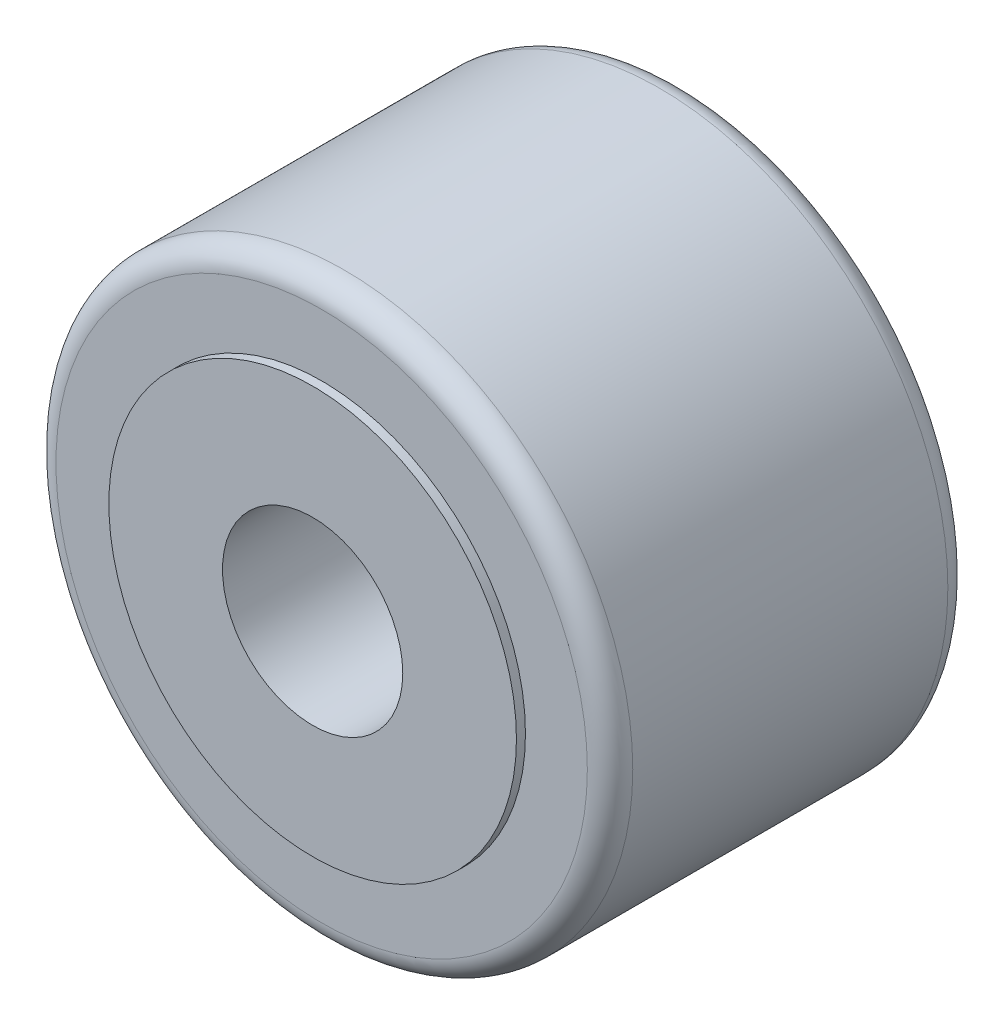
ISO-10303-21;
HEADER;
FILE_DESCRIPTION(('STEP AP214'),'2;1');
FILE_NAME('part.step','',(''),(''),'','','');
FILE_SCHEMA(('AUTOMOTIVE_DESIGN { 1 0 10303 214 1 1 1 1 }'));
ENDSEC;
DATA;
#1=APPLICATION_CONTEXT('core data for automotive mechanical design processes');
#2=APPLICATION_PROTOCOL_DEFINITION('international standard','automotive_design',2000,#1);
#3=PRODUCT_CONTEXT('',#1,'mechanical');
#4=PRODUCT('Part','Part','',(#3));
#5=PRODUCT_RELATED_PRODUCT_CATEGORY('part','',(#4));
#6=PRODUCT_DEFINITION_FORMATION('','',#4);
#7=PRODUCT_DEFINITION_CONTEXT('part definition',#1,'design');
#8=PRODUCT_DEFINITION('design','',#6,#7);
#9=PRODUCT_DEFINITION_SHAPE('','',#8);
#10=(LENGTH_UNIT() NAMED_UNIT(*) SI_UNIT(.MILLI.,.METRE.));
#11=(NAMED_UNIT(*) PLANE_ANGLE_UNIT() SI_UNIT($,.RADIAN.));
#12=(NAMED_UNIT(*) SI_UNIT($,.STERADIAN.) SOLID_ANGLE_UNIT());
#13=UNCERTAINTY_MEASURE_WITH_UNIT(LENGTH_MEASURE(1.E-05),#10,'distance_accuracy_value','');
#14=(GEOMETRIC_REPRESENTATION_CONTEXT(3) GLOBAL_UNCERTAINTY_ASSIGNED_CONTEXT((#13)) GLOBAL_UNIT_ASSIGNED_CONTEXT((#10,
#11,#12)) REPRESENTATION_CONTEXT('',''));
#15=CARTESIAN_POINT('',(0.,0.,0.));
#16=DIRECTION('',(0.,0.,1.));
#17=DIRECTION('',(1.,0.,0.));
#18=AXIS2_PLACEMENT_3D('',#15,#16,#17);
#19=CARTESIAN_POINT('',(0.,0.,-15.875));
#20=DIRECTION('',(0.,0.,1.));
#21=DIRECTION('',(1.,0.,0.));
#22=AXIS2_PLACEMENT_3D('',#19,#20,#21);
#23=CYLINDRICAL_SURFACE('',#22,25.4);
#24=CARTESIAN_POINT('',(0.,0.,-13.875));
#25=DIRECTION('',(0.,0.,1.));
#26=DIRECTION('',(1.,0.,0.));
#27=AXIS2_PLACEMENT_3D('',#24,#25,#26);
#28=CIRCLE('',#27,25.4);
#29=CARTESIAN_POINT('',(25.4,0.,-13.875));
#30=VERTEX_POINT('',#29);
#31=EDGE_CURVE('E41',#30,#30,#28,.T.);
#32=ORIENTED_EDGE('',*,*,#31,.T.);
#33=EDGE_LOOP('',(#32));
#34=FACE_BOUND('',#33,.T.);
#35=CARTESIAN_POINT('',(0.,0.,13.875));
#36=DIRECTION('',(0.,0.,1.));
#37=DIRECTION('',(1.,0.,0.));
#38=AXIS2_PLACEMENT_3D('',#35,#36,#37);
#39=CIRCLE('',#38,25.4);
#40=CARTESIAN_POINT('',(25.4,0.,13.875));
#41=VERTEX_POINT('',#40);
#42=EDGE_CURVE('E45',#41,#41,#39,.F.);
#43=ORIENTED_EDGE('',*,*,#42,.T.);
#44=EDGE_LOOP('',(#43));
#45=FACE_BOUND('',#44,.T.);
#46=ADVANCED_FACE('F30',(#34,#45),#23,.T.);
#47=CARTESIAN_POINT('',(0.,0.,-15.875));
#48=DIRECTION('',(0.,0.,1.));
#49=DIRECTION('',(1.,0.,0.));
#50=AXIS2_PLACEMENT_3D('',#47,#48,#49);
#51=PLANE('',#50);
#52=CARTESIAN_POINT('',(0.,0.,-15.875));
#53=DIRECTION('',(0.,0.,1.));
#54=DIRECTION('',(1.,0.,0.));
#55=AXIS2_PLACEMENT_3D('',#52,#53,#54);
#56=CIRCLE('',#55,23.4);
#57=CARTESIAN_POINT('',(23.4,0.,-15.875));
#58=VERTEX_POINT('',#57);
#59=EDGE_CURVE('E37',#58,#58,#56,.F.);
#60=ORIENTED_EDGE('',*,*,#59,.T.);
#61=EDGE_LOOP('',(#60));
#62=FACE_BOUND('',#61,.T.);
#63=CARTESIAN_POINT('',(0.,0.,-15.875));
#64=DIRECTION('',(0.,0.,1.));
#65=DIRECTION('',(1.,0.,0.));
#66=AXIS2_PLACEMENT_3D('',#63,#64,#65);
#67=CIRCLE('',#66,17.95);
#68=CARTESIAN_POINT('',(17.95,0.,-15.875));
#69=VERTEX_POINT('',#68);
#70=EDGE_CURVE('E53',#69,#69,#67,.T.);
#71=ORIENTED_EDGE('',*,*,#70,.T.);
#72=EDGE_LOOP('',(#71));
#73=FACE_BOUND('',#72,.T.);
#74=ADVANCED_FACE('F91',(#62,#73),#51,.F.);
#75=CARTESIAN_POINT('',(0.,0.,15.875));
#76=DIRECTION('',(0.,0.,1.));
#77=DIRECTION('',(1.,0.,0.));
#78=AXIS2_PLACEMENT_3D('',#75,#76,#77);
#79=PLANE('',#78);
#80=CARTESIAN_POINT('',(0.,0.,15.875));
#81=DIRECTION('',(0.,0.,1.));
#82=DIRECTION('',(1.,0.,0.));
#83=AXIS2_PLACEMENT_3D('',#80,#81,#82);
#84=CIRCLE('',#83,23.4);
#85=CARTESIAN_POINT('',(23.4,0.,15.875));
#86=VERTEX_POINT('',#85);
#87=EDGE_CURVE('E10',#86,#86,#84,.T.);
#88=ORIENTED_EDGE('',*,*,#87,.T.);
#89=EDGE_LOOP('',(#88));
#90=FACE_BOUND('',#89,.T.);
#91=CARTESIAN_POINT('',(0.,0.,15.875));
#92=DIRECTION('',(0.,0.,1.));
#93=DIRECTION('',(1.,0.,0.));
#94=AXIS2_PLACEMENT_3D('',#91,#92,#93);
#95=CIRCLE('',#94,17.95);
#96=CARTESIAN_POINT('',(17.95,0.,15.875));
#97=VERTEX_POINT('',#96);
#98=EDGE_CURVE('E50',#97,#97,#95,.T.);
#99=ORIENTED_EDGE('',*,*,#98,.F.);
#100=EDGE_LOOP('',(#99));
#101=FACE_BOUND('',#100,.T.);
#102=ADVANCED_FACE('F75',(#90,#101),#79,.T.);
#103=CARTESIAN_POINT('',(0.,0.,16.669));
#104=DIRECTION('',(0.,0.,1.));
#105=DIRECTION('',(1.,0.,0.));
#106=AXIS2_PLACEMENT_3D('',#103,#104,#105);
#107=PLANE('',#106);
#108=CARTESIAN_POINT('',(0.,0.,16.669));
#109=DIRECTION('',(0.,0.,1.));
#110=DIRECTION('',(1.,0.,0.));
#111=AXIS2_PLACEMENT_3D('',#108,#109,#110);
#112=CIRCLE('',#111,7.9375);
#113=CARTESIAN_POINT('',(7.9375,0.,16.669));
#114=VERTEX_POINT('',#113);
#115=EDGE_CURVE('E65',#114,#114,#112,.T.);
#116=ORIENTED_EDGE('',*,*,#115,.F.);
#117=EDGE_LOOP('',(#116));
#118=FACE_BOUND('',#117,.T.);
#119=CARTESIAN_POINT('',(0.,0.,16.669));
#120=DIRECTION('',(0.,0.,1.));
#121=DIRECTION('',(1.,0.,0.));
#122=AXIS2_PLACEMENT_3D('',#119,#120,#121);
#123=CIRCLE('',#122,17.95);
#124=CARTESIAN_POINT('',(17.95,0.,16.669));
#125=VERTEX_POINT('',#124);
#126=EDGE_CURVE('E59',#125,#125,#123,.T.);
#127=ORIENTED_EDGE('',*,*,#126,.T.);
#128=EDGE_LOOP('',(#127));
#129=FACE_BOUND('',#128,.T.);
#130=ADVANCED_FACE('F71',(#118,#129),#107,.T.);
#131=CARTESIAN_POINT('',(0.,0.,-16.669));
#132=DIRECTION('',(0.,0.,1.));
#133=DIRECTION('',(1.,0.,0.));
#134=AXIS2_PLACEMENT_3D('',#131,#132,#133);
#135=CYLINDRICAL_SURFACE('',#134,17.95);
#136=ORIENTED_EDGE('',*,*,#98,.T.);
#137=EDGE_LOOP('',(#136));
#138=FACE_BOUND('',#137,.T.);
#139=ORIENTED_EDGE('',*,*,#126,.F.);
#140=EDGE_LOOP('',(#139));
#141=FACE_BOUND('',#140,.T.);
#142=ADVANCED_FACE('F74',(#138,#141),#135,.T.);
#143=CARTESIAN_POINT('',(0.,0.,-16.669));
#144=DIRECTION('',(0.,0.,1.));
#145=DIRECTION('',(1.,0.,0.));
#146=AXIS2_PLACEMENT_3D('',#143,#144,#145);
#147=CIRCLE('',#146,17.95);
#148=CARTESIAN_POINT('',(17.95,0.,-16.669));
#149=VERTEX_POINT('',#148);
#150=EDGE_CURVE('E56',#149,#149,#147,.T.);
#151=ORIENTED_EDGE('',*,*,#150,.T.);
#152=EDGE_LOOP('',(#151));
#153=FACE_BOUND('',#152,.T.);
#154=ORIENTED_EDGE('',*,*,#70,.F.);
#155=EDGE_LOOP('',(#154));
#156=FACE_BOUND('',#155,.T.);
#157=ADVANCED_FACE('F80',(#153,#156),#135,.T.);
#158=CARTESIAN_POINT('',(0.,0.,-16.669));
#159=DIRECTION('',(0.,0.,1.));
#160=DIRECTION('',(1.,0.,0.));
#161=AXIS2_PLACEMENT_3D('',#158,#159,#160);
#162=PLANE('',#161);
#163=CARTESIAN_POINT('',(0.,0.,-16.669));
#164=DIRECTION('',(0.,0.,1.));
#165=DIRECTION('',(1.,0.,0.));
#166=AXIS2_PLACEMENT_3D('',#163,#164,#165);
#167=CIRCLE('',#166,7.9375);
#168=CARTESIAN_POINT('',(7.9375,0.,-16.669));
#169=VERTEX_POINT('',#168);
#170=EDGE_CURVE('E62',#169,#169,#167,.T.);
#171=ORIENTED_EDGE('',*,*,#170,.T.);
#172=EDGE_LOOP('',(#171));
#173=FACE_BOUND('',#172,.T.);
#174=ORIENTED_EDGE('',*,*,#150,.F.);
#175=EDGE_LOOP('',(#174));
#176=FACE_BOUND('',#175,.T.);
#177=ADVANCED_FACE('F86',(#173,#176),#162,.F.);
#178=CARTESIAN_POINT('',(0.,0.,-16.669));
#179=DIRECTION('',(0.,0.,1.));
#180=DIRECTION('',(1.,0.,0.));
#181=AXIS2_PLACEMENT_3D('',#178,#179,#180);
#182=CYLINDRICAL_SURFACE('',#181,7.9375);
#183=ORIENTED_EDGE('',*,*,#170,.F.);
#184=EDGE_LOOP('',(#183));
#185=FACE_BOUND('',#184,.T.);
#186=ORIENTED_EDGE('',*,*,#115,.T.);
#187=EDGE_LOOP('',(#186));
#188=FACE_BOUND('',#187,.T.);
#189=ADVANCED_FACE('F69',(#185,#188),#182,.F.);
#190=CARTESIAN_POINT('',(0.,0.,-13.875));
#191=DIRECTION('',(0.,0.,1.));
#192=DIRECTION('',(1.,0.,0.));
#193=AXIS2_PLACEMENT_3D('',#190,#191,#192);
#194=TOROIDAL_SURFACE('',#193,23.4,2.);
#195=ORIENTED_EDGE('',*,*,#59,.F.);
#196=EDGE_LOOP('',(#195));
#197=FACE_BOUND('',#196,.T.);
#198=ORIENTED_EDGE('',*,*,#31,.F.);
#199=EDGE_LOOP('',(#198));
#200=FACE_BOUND('',#199,.T.);
#201=ADVANCED_FACE('F99',(#197,#200),#194,.T.);
#202=CARTESIAN_POINT('',(0.,0.,13.875));
#203=DIRECTION('',(0.,0.,1.));
#204=DIRECTION('',(1.,0.,0.));
#205=AXIS2_PLACEMENT_3D('',#202,#203,#204);
#206=TOROIDAL_SURFACE('',#205,23.4,2.);
#207=ORIENTED_EDGE('',*,*,#42,.F.);
#208=EDGE_LOOP('',(#207));
#209=FACE_BOUND('',#208,.T.);
#210=ORIENTED_EDGE('',*,*,#87,.F.);
#211=EDGE_LOOP('',(#210));
#212=FACE_BOUND('',#211,.T.);
#213=ADVANCED_FACE('F32',(#209,#212),#206,.T.);
#214=CLOSED_SHELL('',(#46,#74,#102,#130,#142,#157,#177,#189,#201,#213));
#215=MANIFOLD_SOLID_BREP('B2',#214);
#216=ADVANCED_BREP_SHAPE_REPRESENTATION('',(#18,#215),#14);
#217=SHAPE_DEFINITION_REPRESENTATION(#9,#216);
ENDSEC;
END-ISO-10303-21;
